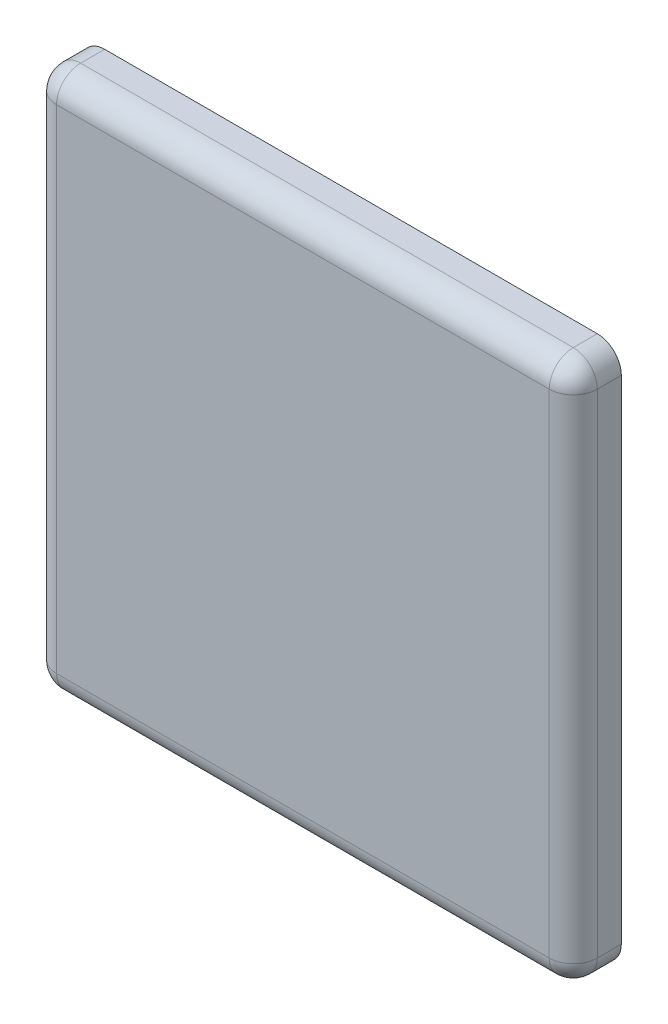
ISO-10303-21;
HEADER;
FILE_DESCRIPTION(('STEP AP214'),'2;1');
FILE_NAME('part.step','',(''),(''),'','','');
FILE_SCHEMA(('AUTOMOTIVE_DESIGN { 1 0 10303 214 1 1 1 1 }'));
ENDSEC;
DATA;
#1=APPLICATION_CONTEXT('core data for automotive mechanical design processes');
#2=APPLICATION_PROTOCOL_DEFINITION('international standard','automotive_design',2000,#1);
#3=PRODUCT_CONTEXT('',#1,'mechanical');
#4=PRODUCT('Part','Part','',(#3));
#5=PRODUCT_RELATED_PRODUCT_CATEGORY('part','',(#4));
#6=PRODUCT_DEFINITION_FORMATION('','',#4);
#7=PRODUCT_DEFINITION_CONTEXT('part definition',#1,'design');
#8=PRODUCT_DEFINITION('design','',#6,#7);
#9=PRODUCT_DEFINITION_SHAPE('','',#8);
#10=(LENGTH_UNIT() NAMED_UNIT(*) SI_UNIT(.MILLI.,.METRE.));
#11=(NAMED_UNIT(*) PLANE_ANGLE_UNIT() SI_UNIT($,.RADIAN.));
#12=(NAMED_UNIT(*) SI_UNIT($,.STERADIAN.) SOLID_ANGLE_UNIT());
#13=UNCERTAINTY_MEASURE_WITH_UNIT(LENGTH_MEASURE(1.E-05),#10,'distance_accuracy_value','');
#14=(GEOMETRIC_REPRESENTATION_CONTEXT(3) GLOBAL_UNCERTAINTY_ASSIGNED_CONTEXT((#13)) GLOBAL_UNIT_ASSIGNED_CONTEXT((#10,
#11,#12)) REPRESENTATION_CONTEXT('',''));
#15=CARTESIAN_POINT('',(0.,0.,0.));
#16=DIRECTION('',(0.,0.,1.));
#17=DIRECTION('',(1.,0.,0.));
#18=AXIS2_PLACEMENT_3D('',#15,#16,#17);
#19=CARTESIAN_POINT('',(0.,0.,4.));
#20=DIRECTION('',(-1.,0.,0.));
#21=DIRECTION('',(0.,0.,1.));
#22=AXIS2_PLACEMENT_3D('',#19,#20,#21);
#23=PLANE('',#22);
#24=DIRECTION('',(0.,1.,0.));
#25=VECTOR('',#24,1.);
#26=CARTESIAN_POINT('',(0.,45.,2.));
#27=LINE('',#26,#25);
#28=CARTESIAN_POINT('',(0.,2.,2.));
#29=VERTEX_POINT('',#28);
#30=CARTESIAN_POINT('',(0.,43.,2.));
#31=VERTEX_POINT('',#30);
#32=EDGE_CURVE('E42',#29,#31,#27,.T.);
#33=ORIENTED_EDGE('',*,*,#32,.T.);
#34=DIRECTION('',(0.,0.,-1.));
#35=VECTOR('',#34,1.);
#36=CARTESIAN_POINT('',(0.,43.,0.));
#37=LINE('',#36,#35);
#38=CARTESIAN_POINT('',(0.,43.,0.));
#39=VERTEX_POINT('',#38);
#40=EDGE_CURVE('E161',#31,#39,#37,.T.);
#41=ORIENTED_EDGE('',*,*,#40,.T.);
#42=DIRECTION('',(0.,1.,0.));
#43=VECTOR('',#42,1.);
#44=CARTESIAN_POINT('',(0.,0.,0.));
#45=LINE('',#44,#43);
#46=CARTESIAN_POINT('',(0.,2.,0.));
#47=VERTEX_POINT('',#46);
#48=EDGE_CURVE('E171',#47,#39,#45,.T.);
#49=ORIENTED_EDGE('',*,*,#48,.F.);
#50=DIRECTION('',(0.,0.,-1.));
#51=VECTOR('',#50,1.);
#52=CARTESIAN_POINT('',(0.,2.,4.));
#53=LINE('',#52,#51);
#54=EDGE_CURVE('E47',#47,#29,#53,.F.);
#55=ORIENTED_EDGE('',*,*,#54,.T.);
#56=EDGE_LOOP('',(#33,#41,#49,#55));
#57=FACE_BOUND('',#56,.T.);
#58=ADVANCED_FACE('F28',(#57),#23,.T.);
#59=CARTESIAN_POINT('',(0.,0.,4.));
#60=DIRECTION('',(0.,1.,0.));
#61=DIRECTION('',(-1.,0.,0.));
#62=AXIS2_PLACEMENT_3D('',#59,#60,#61);
#63=PLANE('',#62);
#64=DIRECTION('',(1.,0.,0.));
#65=VECTOR('',#64,1.);
#66=CARTESIAN_POINT('',(0.,0.,2.));
#67=LINE('',#66,#65);
#68=CARTESIAN_POINT('',(43.,0.,2.));
#69=VERTEX_POINT('',#68);
#70=CARTESIAN_POINT('',(2.,0.,2.));
#71=VERTEX_POINT('',#70);
#72=EDGE_CURVE('E155',#69,#71,#67,.F.);
#73=ORIENTED_EDGE('',*,*,#72,.T.);
#74=DIRECTION('',(0.,0.,-1.));
#75=VECTOR('',#74,1.);
#76=CARTESIAN_POINT('',(2.,0.,0.));
#77=LINE('',#76,#75);
#78=CARTESIAN_POINT('',(2.,0.,0.));
#79=VERTEX_POINT('',#78);
#80=EDGE_CURVE('E157',#71,#79,#77,.T.);
#81=ORIENTED_EDGE('',*,*,#80,.T.);
#82=DIRECTION('',(1.,0.,0.));
#83=VECTOR('',#82,1.);
#84=CARTESIAN_POINT('',(0.,0.,0.));
#85=LINE('',#84,#83);
#86=CARTESIAN_POINT('',(43.,0.,0.));
#87=VERTEX_POINT('',#86);
#88=EDGE_CURVE('E132',#79,#87,#85,.T.);
#89=ORIENTED_EDGE('',*,*,#88,.T.);
#90=DIRECTION('',(0.,0.,-1.));
#91=VECTOR('',#90,1.);
#92=CARTESIAN_POINT('',(43.,0.,4.));
#93=LINE('',#92,#91);
#94=EDGE_CURVE('E153',#87,#69,#93,.F.);
#95=ORIENTED_EDGE('',*,*,#94,.T.);
#96=EDGE_LOOP('',(#73,#81,#89,#95));
#97=FACE_BOUND('',#96,.T.);
#98=ADVANCED_FACE('F246',(#97),#63,.F.);
#99=CARTESIAN_POINT('',(45.,45.,4.));
#100=DIRECTION('',(1.,0.,0.));
#101=DIRECTION('',(0.,0.,-1.));
#102=AXIS2_PLACEMENT_3D('',#99,#100,#101);
#103=PLANE('',#102);
#104=DIRECTION('',(0.,-1.,0.));
#105=VECTOR('',#104,1.);
#106=CARTESIAN_POINT('',(45.,0.,2.));
#107=LINE('',#106,#105);
#108=CARTESIAN_POINT('',(45.,43.,2.));
#109=VERTEX_POINT('',#108);
#110=CARTESIAN_POINT('',(45.,2.,2.));
#111=VERTEX_POINT('',#110);
#112=EDGE_CURVE('E149',#109,#111,#107,.T.);
#113=ORIENTED_EDGE('',*,*,#112,.T.);
#114=DIRECTION('',(0.,0.,-1.));
#115=VECTOR('',#114,1.);
#116=CARTESIAN_POINT('',(45.,2.,0.));
#117=LINE('',#116,#115);
#118=CARTESIAN_POINT('',(45.,2.,0.));
#119=VERTEX_POINT('',#118);
#120=EDGE_CURVE('E151',#111,#119,#117,.T.);
#121=ORIENTED_EDGE('',*,*,#120,.T.);
#122=DIRECTION('',(0.,-1.,0.));
#123=VECTOR('',#122,1.);
#124=CARTESIAN_POINT('',(45.,45.,0.));
#125=LINE('',#124,#123);
#126=CARTESIAN_POINT('',(45.,43.,0.));
#127=VERTEX_POINT('',#126);
#128=EDGE_CURVE('E205',#127,#119,#125,.T.);
#129=ORIENTED_EDGE('',*,*,#128,.F.);
#130=DIRECTION('',(0.,0.,-1.));
#131=VECTOR('',#130,1.);
#132=CARTESIAN_POINT('',(45.,43.,4.));
#133=LINE('',#132,#131);
#134=EDGE_CURVE('E147',#127,#109,#133,.F.);
#135=ORIENTED_EDGE('',*,*,#134,.T.);
#136=EDGE_LOOP('',(#113,#121,#129,#135));
#137=FACE_BOUND('',#136,.T.);
#138=ADVANCED_FACE('F240',(#137),#103,.T.);
#139=CARTESIAN_POINT('',(45.,45.,4.));
#140=DIRECTION('',(0.,-1.,0.));
#141=DIRECTION('',(1.,0.,0.));
#142=AXIS2_PLACEMENT_3D('',#139,#140,#141);
#143=PLANE('',#142);
#144=DIRECTION('',(-1.,0.,0.));
#145=VECTOR('',#144,1.);
#146=CARTESIAN_POINT('',(45.,45.,0.));
#147=LINE('',#146,#145);
#148=CARTESIAN_POINT('',(43.,45.,0.));
#149=VERTEX_POINT('',#148);
#150=CARTESIAN_POINT('',(2.,45.,0.));
#151=VERTEX_POINT('',#150);
#152=EDGE_CURVE('E176',#149,#151,#147,.T.);
#153=ORIENTED_EDGE('',*,*,#152,.T.);
#154=DIRECTION('',(0.,0.,-1.));
#155=VECTOR('',#154,1.);
#156=CARTESIAN_POINT('',(2.,45.,4.));
#157=LINE('',#156,#155);
#158=CARTESIAN_POINT('',(2.,45.,2.));
#159=VERTEX_POINT('',#158);
#160=EDGE_CURVE('E145',#151,#159,#157,.F.);
#161=ORIENTED_EDGE('',*,*,#160,.T.);
#162=DIRECTION('',(-1.,0.,0.));
#163=VECTOR('',#162,1.);
#164=CARTESIAN_POINT('',(45.,45.,2.));
#165=LINE('',#164,#163);
#166=CARTESIAN_POINT('',(43.,45.,2.));
#167=VERTEX_POINT('',#166);
#168=EDGE_CURVE('E110',#159,#167,#165,.F.);
#169=ORIENTED_EDGE('',*,*,#168,.T.);
#170=DIRECTION('',(0.,0.,-1.));
#171=VECTOR('',#170,1.);
#172=CARTESIAN_POINT('',(43.,45.,0.));
#173=LINE('',#172,#171);
#174=EDGE_CURVE('E138',#167,#149,#173,.T.);
#175=ORIENTED_EDGE('',*,*,#174,.T.);
#176=EDGE_LOOP('',(#153,#161,#169,#175));
#177=FACE_BOUND('',#176,.T.);
#178=ADVANCED_FACE('F233',(#177),#143,.F.);
#179=CARTESIAN_POINT('',(0.,0.,4.));
#180=DIRECTION('',(0.,0.,-1.));
#181=DIRECTION('',(-1.,0.,0.));
#182=AXIS2_PLACEMENT_3D('',#179,#180,#181);
#183=PLANE('',#182);
#184=DIRECTION('',(0.,-1.,0.));
#185=VECTOR('',#184,1.);
#186=CARTESIAN_POINT('',(43.,45.,4.));
#187=LINE('',#186,#185);
#188=CARTESIAN_POINT('',(43.,2.,4.));
#189=VERTEX_POINT('',#188);
#190=CARTESIAN_POINT('',(43.,43.,4.));
#191=VERTEX_POINT('',#190);
#192=EDGE_CURVE('E136',#189,#191,#187,.F.);
#193=ORIENTED_EDGE('',*,*,#192,.T.);
#194=DIRECTION('',(-1.,0.,0.));
#195=VECTOR('',#194,1.);
#196=CARTESIAN_POINT('',(0.,43.,4.));
#197=LINE('',#196,#195);
#198=CARTESIAN_POINT('',(2.,43.,4.));
#199=VERTEX_POINT('',#198);
#200=EDGE_CURVE('E108',#191,#199,#197,.T.);
#201=ORIENTED_EDGE('',*,*,#200,.T.);
#202=DIRECTION('',(0.,1.,0.));
#203=VECTOR('',#202,1.);
#204=CARTESIAN_POINT('',(2.,0.,4.));
#205=LINE('',#204,#203);
#206=CARTESIAN_POINT('',(2.,2.,4.));
#207=VERTEX_POINT('',#206);
#208=EDGE_CURVE('E125',#199,#207,#205,.F.);
#209=ORIENTED_EDGE('',*,*,#208,.T.);
#210=DIRECTION('',(1.,0.,0.));
#211=VECTOR('',#210,1.);
#212=CARTESIAN_POINT('',(0.,2.,4.));
#213=LINE('',#212,#211);
#214=EDGE_CURVE('E131',#207,#189,#213,.T.);
#215=ORIENTED_EDGE('',*,*,#214,.T.);
#216=EDGE_LOOP('',(#193,#201,#209,#215));
#217=FACE_BOUND('',#216,.T.);
#218=ADVANCED_FACE('F134',(#217),#183,.F.);
#219=CARTESIAN_POINT('',(0.,0.,0.));
#220=DIRECTION('',(0.,0.,-1.));
#221=DIRECTION('',(-1.,0.,0.));
#222=AXIS2_PLACEMENT_3D('',#219,#220,#221);
#223=PLANE('',#222);
#224=ORIENTED_EDGE('',*,*,#48,.T.);
#225=CARTESIAN_POINT('',(2.,43.,0.));
#226=DIRECTION('',(0.,0.,-1.));
#227=DIRECTION('',(-1.,0.,0.));
#228=AXIS2_PLACEMENT_3D('',#225,#226,#227);
#229=CIRCLE('',#228,2.);
#230=EDGE_CURVE('E11',#39,#151,#229,.T.);
#231=ORIENTED_EDGE('',*,*,#230,.T.);
#232=ORIENTED_EDGE('',*,*,#152,.F.);
#233=CARTESIAN_POINT('',(43.,43.,0.));
#234=DIRECTION('',(0.,0.,-1.));
#235=DIRECTION('',(-1.,0.,0.));
#236=AXIS2_PLACEMENT_3D('',#233,#234,#235);
#237=CIRCLE('',#236,2.);
#238=EDGE_CURVE('E163',#149,#127,#237,.T.);
#239=ORIENTED_EDGE('',*,*,#238,.T.);
#240=ORIENTED_EDGE('',*,*,#128,.T.);
#241=CARTESIAN_POINT('',(43.,2.,0.));
#242=DIRECTION('',(0.,0.,-1.));
#243=DIRECTION('',(-1.,0.,0.));
#244=AXIS2_PLACEMENT_3D('',#241,#242,#243);
#245=CIRCLE('',#244,2.);
#246=EDGE_CURVE('E165',#119,#87,#245,.T.);
#247=ORIENTED_EDGE('',*,*,#246,.T.);
#248=ORIENTED_EDGE('',*,*,#88,.F.);
#249=CARTESIAN_POINT('',(2.,2.,0.));
#250=DIRECTION('',(0.,0.,-1.));
#251=DIRECTION('',(-1.,0.,0.));
#252=AXIS2_PLACEMENT_3D('',#249,#250,#251);
#253=CIRCLE('',#252,2.);
#254=EDGE_CURVE('E35',#79,#47,#253,.T.);
#255=ORIENTED_EDGE('',*,*,#254,.T.);
#256=EDGE_LOOP('',(#224,#231,#232,#239,#240,#247,#248,#255));
#257=FACE_BOUND('',#256,.T.);
#258=ADVANCED_FACE('F170',(#257),#223,.T.);
#259=CARTESIAN_POINT('',(43.,2.,4.));
#260=DIRECTION('',(0.,0.,1.));
#261=DIRECTION('',(1.,0.,0.));
#262=AXIS2_PLACEMENT_3D('',#259,#260,#261);
#263=CYLINDRICAL_SURFACE('',#262,2.);
#264=ORIENTED_EDGE('',*,*,#246,.F.);
#265=ORIENTED_EDGE('',*,*,#120,.F.);
#266=CARTESIAN_POINT('',(43.,2.,2.));
#267=DIRECTION('',(0.,0.,1.));
#268=DIRECTION('',(1.,0.,0.));
#269=AXIS2_PLACEMENT_3D('',#266,#267,#268);
#270=CIRCLE('',#269,2.);
#271=EDGE_CURVE('E177',#69,#111,#270,.T.);
#272=ORIENTED_EDGE('',*,*,#271,.F.);
#273=ORIENTED_EDGE('',*,*,#94,.F.);
#274=EDGE_LOOP('',(#264,#265,#272,#273));
#275=FACE_BOUND('',#274,.T.);
#276=ADVANCED_FACE('F243',(#275),#263,.T.);
#277=CARTESIAN_POINT('',(0.,2.,2.));
#278=DIRECTION('',(1.,0.,0.));
#279=DIRECTION('',(0.,1.,0.));
#280=AXIS2_PLACEMENT_3D('',#277,#278,#279);
#281=CYLINDRICAL_SURFACE('',#280,2.);
#282=CARTESIAN_POINT('',(2.,2.,2.));
#283=DIRECTION('',(-1.,0.,0.));
#284=DIRECTION('',(0.,0.,1.));
#285=AXIS2_PLACEMENT_3D('',#282,#283,#284);
#286=CIRCLE('',#285,2.);
#287=EDGE_CURVE('E185',#71,#207,#286,.T.);
#288=ORIENTED_EDGE('',*,*,#287,.F.);
#289=ORIENTED_EDGE('',*,*,#72,.F.);
#290=CARTESIAN_POINT('',(43.,2.,2.));
#291=DIRECTION('',(1.,0.,0.));
#292=DIRECTION('',(0.,0.,-1.));
#293=AXIS2_PLACEMENT_3D('',#290,#291,#292);
#294=CIRCLE('',#293,2.);
#295=EDGE_CURVE('E198',#189,#69,#294,.T.);
#296=ORIENTED_EDGE('',*,*,#295,.F.);
#297=ORIENTED_EDGE('',*,*,#214,.F.);
#298=EDGE_LOOP('',(#288,#289,#296,#297));
#299=FACE_BOUND('',#298,.T.);
#300=ADVANCED_FACE('F212',(#299),#281,.T.);
#301=CARTESIAN_POINT('',(2.,2.,4.));
#302=DIRECTION('',(0.,0.,1.));
#303=DIRECTION('',(1.,0.,0.));
#304=AXIS2_PLACEMENT_3D('',#301,#302,#303);
#305=CYLINDRICAL_SURFACE('',#304,2.);
#306=ORIENTED_EDGE('',*,*,#254,.F.);
#307=ORIENTED_EDGE('',*,*,#80,.F.);
#308=CARTESIAN_POINT('',(2.,2.,2.));
#309=DIRECTION('',(0.,0.,1.));
#310=DIRECTION('',(1.,0.,0.));
#311=AXIS2_PLACEMENT_3D('',#308,#309,#310);
#312=CIRCLE('',#311,2.);
#313=EDGE_CURVE('E181',#29,#71,#312,.T.);
#314=ORIENTED_EDGE('',*,*,#313,.F.);
#315=ORIENTED_EDGE('',*,*,#54,.F.);
#316=EDGE_LOOP('',(#306,#307,#314,#315));
#317=FACE_BOUND('',#316,.T.);
#318=ADVANCED_FACE('F179',(#317),#305,.T.);
#319=CARTESIAN_POINT('',(43.,2.,2.));
#320=DIRECTION('',(0.,0.,1.));
#321=DIRECTION('',(1.,0.,0.));
#322=AXIS2_PLACEMENT_3D('',#319,#320,#321);
#323=SPHERICAL_SURFACE('',#322,2.);
#324=ORIENTED_EDGE('',*,*,#295,.T.);
#325=ORIENTED_EDGE('',*,*,#271,.T.);
#326=CARTESIAN_POINT('',(43.,2.,2.));
#327=DIRECTION('',(0.,-1.,0.));
#328=DIRECTION('',(0.,0.,-1.));
#329=AXIS2_PLACEMENT_3D('',#326,#327,#328);
#330=CIRCLE('',#329,2.);
#331=EDGE_CURVE('E186',#189,#111,#330,.F.);
#332=ORIENTED_EDGE('',*,*,#331,.F.);
#333=EDGE_LOOP('',(#324,#325,#332));
#334=FACE_BOUND('',#333,.T.);
#335=ADVANCED_FACE('F215',(#334),#323,.T.);
#336=CARTESIAN_POINT('',(2.,2.,2.));
#337=DIRECTION('',(0.,0.,1.));
#338=DIRECTION('',(1.,0.,0.));
#339=AXIS2_PLACEMENT_3D('',#336,#337,#338);
#340=SPHERICAL_SURFACE('',#339,2.);
#341=ORIENTED_EDGE('',*,*,#313,.T.);
#342=ORIENTED_EDGE('',*,*,#287,.T.);
#343=CARTESIAN_POINT('',(2.,2.,2.));
#344=DIRECTION('',(0.,-1.,0.));
#345=DIRECTION('',(0.,0.,-1.));
#346=AXIS2_PLACEMENT_3D('',#343,#344,#345);
#347=CIRCLE('',#346,2.);
#348=EDGE_CURVE('E128',#29,#207,#347,.F.);
#349=ORIENTED_EDGE('',*,*,#348,.F.);
#350=EDGE_LOOP('',(#341,#342,#349));
#351=FACE_BOUND('',#350,.T.);
#352=ADVANCED_FACE('F188',(#351),#340,.T.);
#353=CARTESIAN_POINT('',(43.,43.,4.));
#354=DIRECTION('',(0.,0.,1.));
#355=DIRECTION('',(1.,0.,0.));
#356=AXIS2_PLACEMENT_3D('',#353,#354,#355);
#357=CYLINDRICAL_SURFACE('',#356,2.);
#358=ORIENTED_EDGE('',*,*,#238,.F.);
#359=ORIENTED_EDGE('',*,*,#174,.F.);
#360=CARTESIAN_POINT('',(43.,43.,2.));
#361=DIRECTION('',(0.,0.,1.));
#362=DIRECTION('',(1.,0.,0.));
#363=AXIS2_PLACEMENT_3D('',#360,#361,#362);
#364=CIRCLE('',#363,2.);
#365=EDGE_CURVE('E189',#109,#167,#364,.T.);
#366=ORIENTED_EDGE('',*,*,#365,.F.);
#367=ORIENTED_EDGE('',*,*,#134,.F.);
#368=EDGE_LOOP('',(#358,#359,#366,#367));
#369=FACE_BOUND('',#368,.T.);
#370=ADVANCED_FACE('F230',(#369),#357,.T.);
#371=CARTESIAN_POINT('',(43.,45.,2.));
#372=DIRECTION('',(0.,1.,0.));
#373=DIRECTION('',(0.,0.,1.));
#374=AXIS2_PLACEMENT_3D('',#371,#372,#373);
#375=CYLINDRICAL_SURFACE('',#374,2.);
#376=ORIENTED_EDGE('',*,*,#331,.T.);
#377=ORIENTED_EDGE('',*,*,#112,.F.);
#378=CARTESIAN_POINT('',(43.,43.,2.));
#379=DIRECTION('',(0.,1.,0.));
#380=DIRECTION('',(0.,0.,1.));
#381=AXIS2_PLACEMENT_3D('',#378,#379,#380);
#382=CIRCLE('',#381,2.);
#383=EDGE_CURVE('E122',#191,#109,#382,.T.);
#384=ORIENTED_EDGE('',*,*,#383,.F.);
#385=ORIENTED_EDGE('',*,*,#192,.F.);
#386=EDGE_LOOP('',(#376,#377,#384,#385));
#387=FACE_BOUND('',#386,.T.);
#388=ADVANCED_FACE('F218',(#387),#375,.T.);
#389=CARTESIAN_POINT('',(2.,0.,2.));
#390=DIRECTION('',(0.,-1.,0.));
#391=DIRECTION('',(0.,0.,-1.));
#392=AXIS2_PLACEMENT_3D('',#389,#390,#391);
#393=CYLINDRICAL_SURFACE('',#392,2.);
#394=ORIENTED_EDGE('',*,*,#348,.T.);
#395=ORIENTED_EDGE('',*,*,#208,.F.);
#396=CARTESIAN_POINT('',(2.,43.,2.));
#397=DIRECTION('',(0.,1.,0.));
#398=DIRECTION('',(0.,0.,1.));
#399=AXIS2_PLACEMENT_3D('',#396,#397,#398);
#400=CIRCLE('',#399,2.);
#401=EDGE_CURVE('E116',#31,#199,#400,.T.);
#402=ORIENTED_EDGE('',*,*,#401,.F.);
#403=ORIENTED_EDGE('',*,*,#32,.F.);
#404=EDGE_LOOP('',(#394,#395,#402,#403));
#405=FACE_BOUND('',#404,.T.);
#406=ADVANCED_FACE('F126',(#405),#393,.T.);
#407=CARTESIAN_POINT('',(2.,43.,4.));
#408=DIRECTION('',(0.,0.,1.));
#409=DIRECTION('',(1.,0.,0.));
#410=AXIS2_PLACEMENT_3D('',#407,#408,#409);
#411=CYLINDRICAL_SURFACE('',#410,2.);
#412=ORIENTED_EDGE('',*,*,#230,.F.);
#413=ORIENTED_EDGE('',*,*,#40,.F.);
#414=CARTESIAN_POINT('',(2.,43.,2.));
#415=DIRECTION('',(0.,0.,1.));
#416=DIRECTION('',(1.,0.,0.));
#417=AXIS2_PLACEMENT_3D('',#414,#415,#416);
#418=CIRCLE('',#417,2.);
#419=EDGE_CURVE('E120',#159,#31,#418,.T.);
#420=ORIENTED_EDGE('',*,*,#419,.F.);
#421=ORIENTED_EDGE('',*,*,#160,.F.);
#422=EDGE_LOOP('',(#412,#413,#420,#421));
#423=FACE_BOUND('',#422,.T.);
#424=ADVANCED_FACE('F236',(#423),#411,.T.);
#425=CARTESIAN_POINT('',(43.,43.,2.));
#426=DIRECTION('',(0.,0.,1.));
#427=DIRECTION('',(1.,0.,0.));
#428=AXIS2_PLACEMENT_3D('',#425,#426,#427);
#429=SPHERICAL_SURFACE('',#428,2.);
#430=ORIENTED_EDGE('',*,*,#383,.T.);
#431=ORIENTED_EDGE('',*,*,#365,.T.);
#432=CARTESIAN_POINT('',(43.,43.,2.));
#433=DIRECTION('',(1.,0.,0.));
#434=DIRECTION('',(0.,0.,-1.));
#435=AXIS2_PLACEMENT_3D('',#432,#433,#434);
#436=CIRCLE('',#435,2.);
#437=EDGE_CURVE('E113',#191,#167,#436,.F.);
#438=ORIENTED_EDGE('',*,*,#437,.F.);
#439=EDGE_LOOP('',(#430,#431,#438));
#440=FACE_BOUND('',#439,.T.);
#441=ADVANCED_FACE('F223',(#440),#429,.T.);
#442=CARTESIAN_POINT('',(2.,43.,2.));
#443=DIRECTION('',(0.,0.,1.));
#444=DIRECTION('',(1.,0.,0.));
#445=AXIS2_PLACEMENT_3D('',#442,#443,#444);
#446=SPHERICAL_SURFACE('',#445,2.);
#447=ORIENTED_EDGE('',*,*,#419,.T.);
#448=ORIENTED_EDGE('',*,*,#401,.T.);
#449=CARTESIAN_POINT('',(2.,43.,2.));
#450=DIRECTION('',(-1.,0.,0.));
#451=DIRECTION('',(0.,-1.,0.));
#452=AXIS2_PLACEMENT_3D('',#449,#450,#451);
#453=CIRCLE('',#452,2.);
#454=EDGE_CURVE('E104',#159,#199,#453,.F.);
#455=ORIENTED_EDGE('',*,*,#454,.F.);
#456=EDGE_LOOP('',(#447,#448,#455));
#457=FACE_BOUND('',#456,.T.);
#458=ADVANCED_FACE('F118',(#457),#446,.T.);
#459=CARTESIAN_POINT('',(0.,43.,2.));
#460=DIRECTION('',(-1.,0.,0.));
#461=DIRECTION('',(0.,-1.,0.));
#462=AXIS2_PLACEMENT_3D('',#459,#460,#461);
#463=CYLINDRICAL_SURFACE('',#462,2.);
#464=ORIENTED_EDGE('',*,*,#437,.T.);
#465=ORIENTED_EDGE('',*,*,#168,.F.);
#466=ORIENTED_EDGE('',*,*,#454,.T.);
#467=ORIENTED_EDGE('',*,*,#200,.F.);
#468=EDGE_LOOP('',(#464,#465,#466,#467));
#469=FACE_BOUND('',#468,.T.);
#470=ADVANCED_FACE('F106',(#469),#463,.T.);
#471=CLOSED_SHELL('',(#58,#98,#138,#178,#218,#258,#276,#300,#318,#335,#352,#370,#388,#406,#424,
#441,#458,#470));
#472=MANIFOLD_SOLID_BREP('B2',#471);
#473=ADVANCED_BREP_SHAPE_REPRESENTATION('',(#18,#472),#14);
#474=SHAPE_DEFINITION_REPRESENTATION(#9,#473);
ENDSEC;
END-ISO-10303-21;
